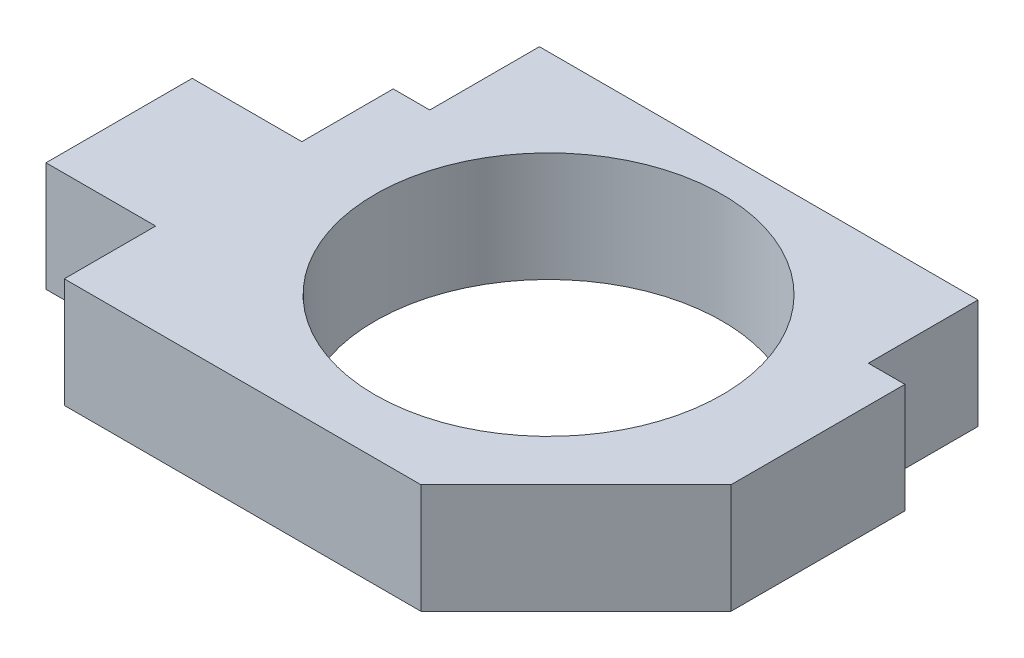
from build123d import *

# Parameters (mm, degrees)
BOSS_EXTRUDE1_DEPTH = 3
SKETCH2_W           = 3
SKETCH2_H           = 4
SKETCH2_W_2         = 12
SKETCH2_H_2         = 3
BOSS_EXTRUDE2_DEPTH = 3
SKETCH4_R           = 4.75
CUT_EXTRUDE3_DEPTH  = 3


with BuildPart() as part:
    # Sketch1 → Boss-Extrude1 (new body)
    with BuildSketch(Plane(origin=(0, 0, 0), x_dir=(1, 0, 0), z_dir=(0, 1, 0))):
        Polygon((7, -0.257359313), (2.757359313, -4.5), (-7, -4.5), (-7, 4.5), (7, 4.5), align=None)
    extrude(amount=BOSS_EXTRUDE1_DEPTH)

    # Sketch2 → Boss-Extrude2 (add)
    with BuildSketch(Plane(origin=(0, 0, 0), x_dir=(1, 0, 0), z_dir=(0, 1, 0))):
        with Locations((-8.5, 0)):
            Rectangle(SKETCH2_W, SKETCH2_H)
        with Locations((0, 6)):
            Rectangle(SKETCH2_W_2, SKETCH2_H_2)
    extrude(amount=BOSS_EXTRUDE2_DEPTH)

    # Sketch4 → Cut-Extrude3 (cut)
    with BuildSketch(Plane(origin=(0, 0, 0), x_dir=(1, 0, 0), z_dir=(0, 1, 0))):
        with Locations(Location((0, 1.75, 0), (0, 0, 270))):
            Circle(SKETCH4_R)
    extrude(amount=CUT_EXTRUDE3_DEPTH, mode=Mode.SUBTRACT)


solid = part.part
